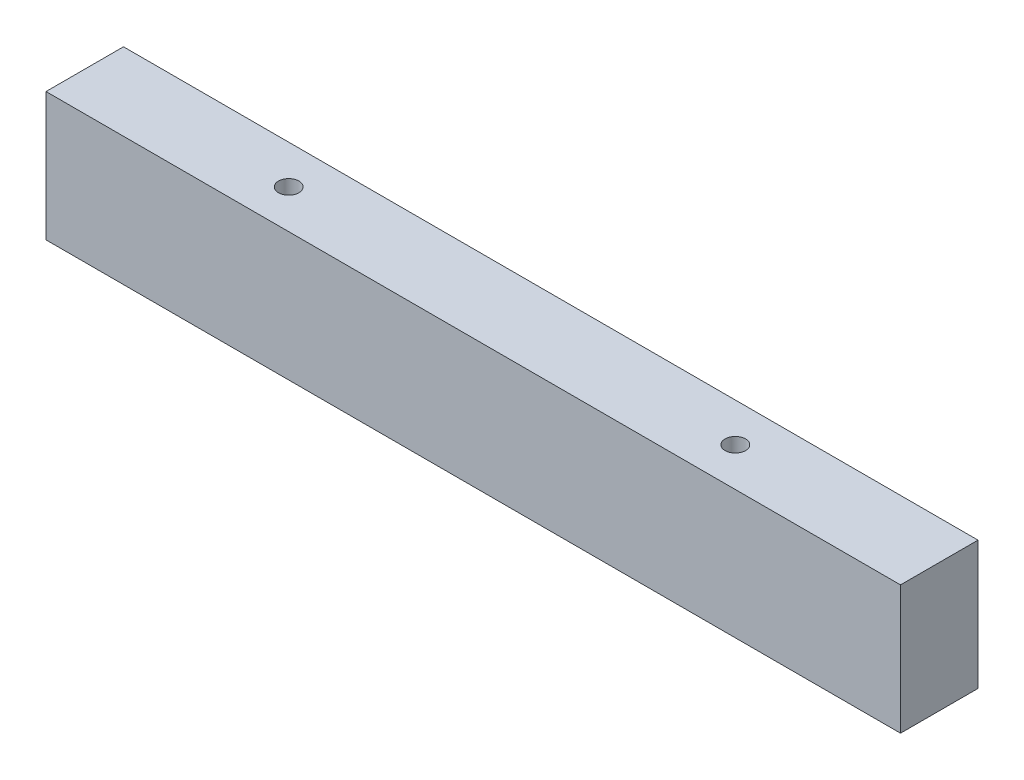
from build123d import *

# Parameters (mm, degrees)
SKETCH1_W           = 419
SKETCH1_H           = 63
BOSS_EXTRUDE1_DEPTH = 38
CUT_EXTRUDE2_REACH  = 427.41
SKETCH2_R           = 5


with BuildPart() as part:
    # Sketch1 → Boss-Extrude1 (new body)
    with BuildSketch(Plane.XY):
        with Locations((209.5, 31.5)):
            Rectangle(SKETCH1_W, SKETCH1_H)
    extrude(amount=BOSS_EXTRUDE1_DEPTH)

    # Sketch2 → Cut-Extrude2 (cut, up to next)
    with BuildSketch(Plane(origin=(0, 63, 0), x_dir=(1, 0, 0), z_dir=(0, 1, 0)), mode=Mode.PRIVATE) as cut_extrude2_sk1:
        with Locations(Location((100, -19, 0), (0, 0, 270))):
            Circle(SKETCH2_R)
    cut_extrude2_tool1 = extrude(cut_extrude2_sk1.sketch, amount=-CUT_EXTRUDE2_REACH, mode=Mode.PRIVATE) & part.part
    # Sketch2 → Cut-Extrude2 (cut, up to next)
    with BuildSketch(Plane(origin=(0, 63, 0), x_dir=(1, 0, 0), z_dir=(0, 1, 0)), mode=Mode.PRIVATE) as cut_extrude2_sk2:
        with Locations(Location((319, -19, 0), (0, 0, 270))):
            Circle(SKETCH2_R)
    cut_extrude2_tool2 = extrude(cut_extrude2_sk2.sketch, amount=-CUT_EXTRUDE2_REACH, mode=Mode.PRIVATE) & part.part
    add(cut_extrude2_tool1.solids().sort_by_distance((100, 63, 19))[0], mode=Mode.SUBTRACT)
    add(cut_extrude2_tool2.solids().sort_by_distance((319, 63, 19))[0], mode=Mode.SUBTRACT)


solid = part.part
